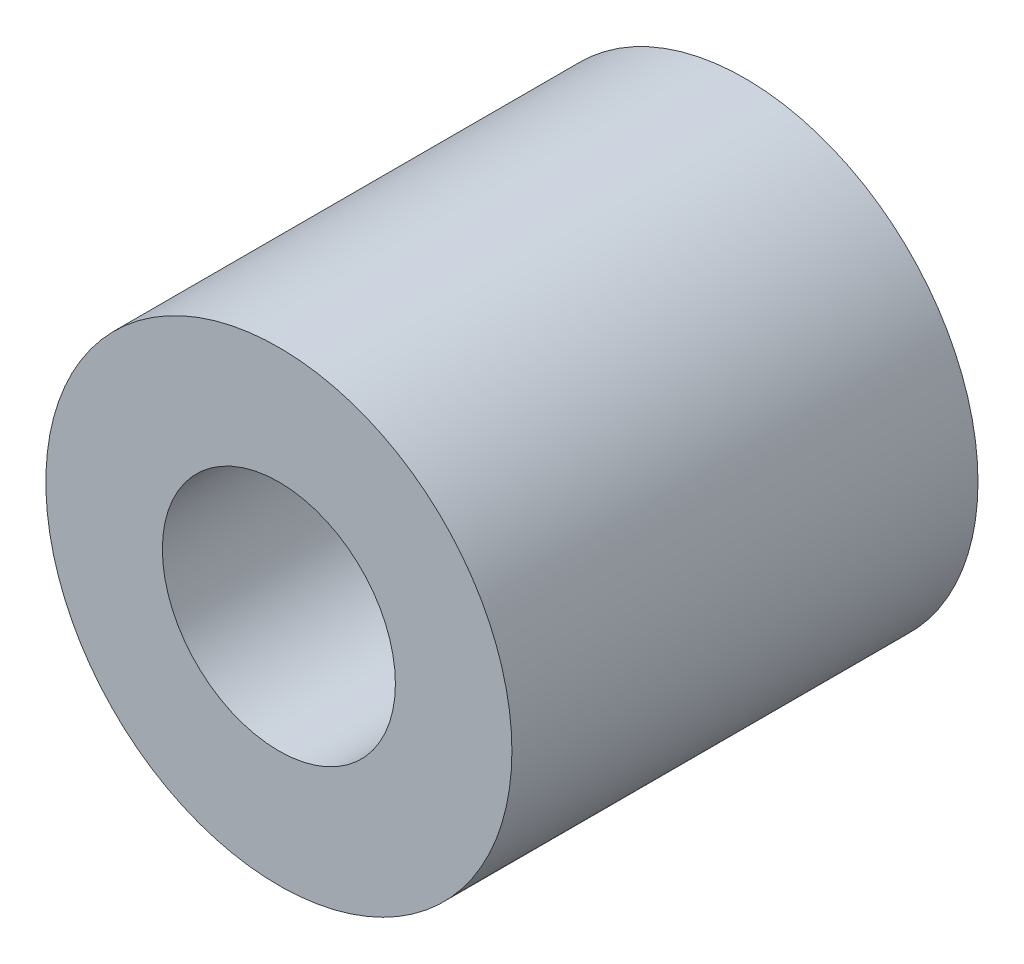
from build123d import *

# Parameters (mm, degrees)
ESQUISSE1_R      = 3
ESQUISSE1_R_2    = 1.5
EXTRUSION1_DEPTH = 6


with BuildPart() as part:
    # Esquisse1 → Extrusion1 (new body)
    with BuildSketch(Plane.XY):
        Circle(ESQUISSE1_R)
        Circle(ESQUISSE1_R_2, mode=Mode.SUBTRACT)
    extrude(amount=EXTRUSION1_DEPTH)


solid = part.part
